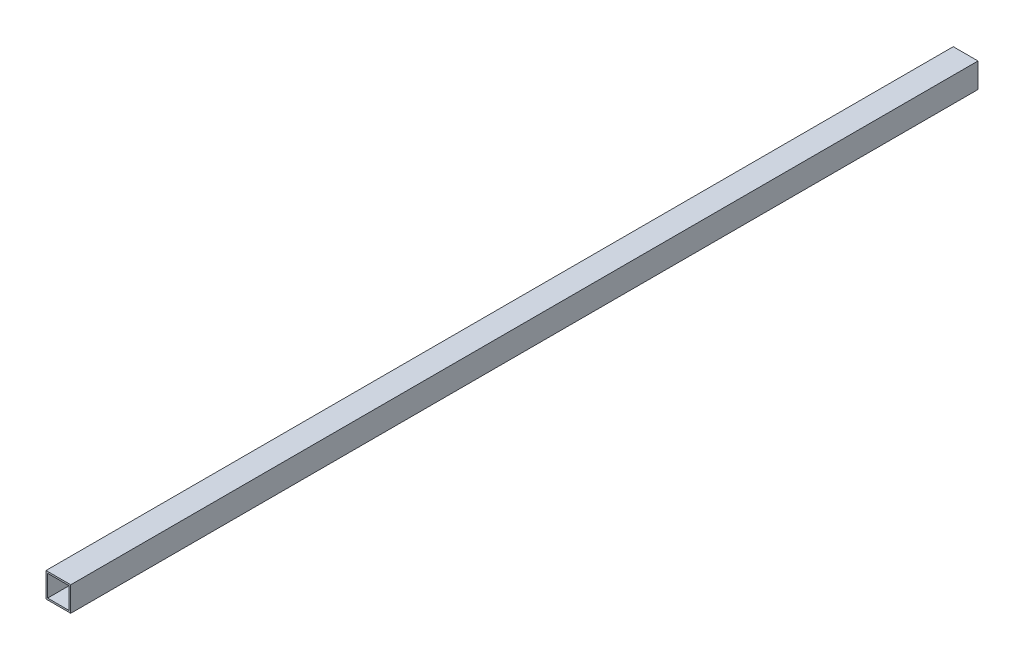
from build123d import *

# Parameters (mm, degrees)
ESQUISSE1_W        = 30
ESQUISSE1_H        = 30
ESQUISSE1_W_2      = 26
ESQUISSE1_H_2      = 26
EXTRU_MINCE1_DEPTH = 1100


with BuildPart() as part:
    # Esquisse1 → Extru.-Mince1 (new body)
    with BuildSketch(Plane.XY):
        Rectangle(ESQUISSE1_W, ESQUISSE1_H)
        Rectangle(ESQUISSE1_W_2, ESQUISSE1_H_2, mode=Mode.SUBTRACT)
    extrude(amount=EXTRU_MINCE1_DEPTH)


solid = part.part
